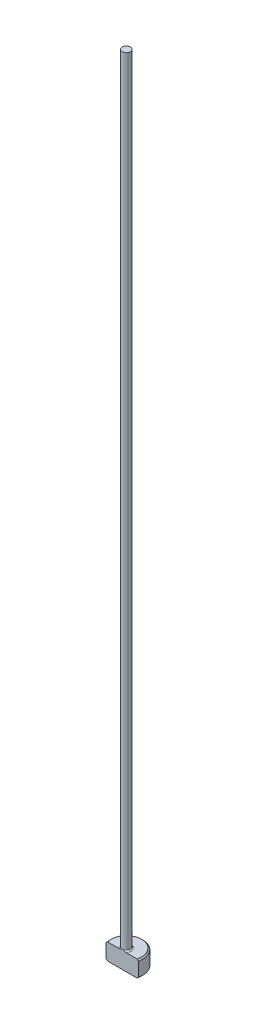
ISO-10303-21;
HEADER;
FILE_DESCRIPTION(('STEP AP214'),'2;1');
FILE_NAME('part.step','',(''),(''),'','','');
FILE_SCHEMA(('AUTOMOTIVE_DESIGN { 1 0 10303 214 1 1 1 1 }'));
ENDSEC;
DATA;
#1=APPLICATION_CONTEXT('core data for automotive mechanical design processes');
#2=APPLICATION_PROTOCOL_DEFINITION('international standard','automotive_design',2000,#1);
#3=PRODUCT_CONTEXT('',#1,'mechanical');
#4=PRODUCT('Part','Part','',(#3));
#5=PRODUCT_RELATED_PRODUCT_CATEGORY('part','',(#4));
#6=PRODUCT_DEFINITION_FORMATION('','',#4);
#7=PRODUCT_DEFINITION_CONTEXT('part definition',#1,'design');
#8=PRODUCT_DEFINITION('design','',#6,#7);
#9=PRODUCT_DEFINITION_SHAPE('','',#8);
#10=(LENGTH_UNIT() NAMED_UNIT(*) SI_UNIT(.MILLI.,.METRE.));
#11=(NAMED_UNIT(*) PLANE_ANGLE_UNIT() SI_UNIT($,.RADIAN.));
#12=(NAMED_UNIT(*) SI_UNIT($,.STERADIAN.) SOLID_ANGLE_UNIT());
#13=UNCERTAINTY_MEASURE_WITH_UNIT(LENGTH_MEASURE(1.E-05),#10,'distance_accuracy_value','');
#14=(GEOMETRIC_REPRESENTATION_CONTEXT(3) GLOBAL_UNCERTAINTY_ASSIGNED_CONTEXT((#13)) GLOBAL_UNIT_ASSIGNED_CONTEXT((#10,
#11,#12)) REPRESENTATION_CONTEXT('',''));
#15=CARTESIAN_POINT('',(0.,0.,0.));
#16=DIRECTION('',(0.,0.,1.));
#17=DIRECTION('',(1.,0.,0.));
#18=AXIS2_PLACEMENT_3D('',#15,#16,#17);
#19=CARTESIAN_POINT('',(0.,0.,0.));
#20=DIRECTION('',(0.,-1.,0.));
#21=DIRECTION('',(0.,0.,-1.));
#22=AXIS2_PLACEMENT_3D('',#19,#20,#21);
#23=PLANE('',#22);
#24=CARTESIAN_POINT('',(0.,0.,0.));
#25=DIRECTION('',(0.,-1.,0.));
#26=DIRECTION('',(0.,0.,-1.));
#27=AXIS2_PLACEMENT_3D('',#24,#25,#26);
#28=CIRCLE('',#27,2.92099999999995);
#29=CARTESIAN_POINT('',(-2.81108554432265,0.,0.793749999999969));
#30=VERTEX_POINT('',#29);
#31=CARTESIAN_POINT('',(2.81108554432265,0.,0.793749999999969));
#32=VERTEX_POINT('',#31);
#33=EDGE_CURVE('E98',#30,#32,#28,.T.);
#34=ORIENTED_EDGE('',*,*,#33,.T.);
#35=DIRECTION('',(-1.,0.,0.));
#36=VECTOR('',#35,1.);
#37=CARTESIAN_POINT('',(-3.07418053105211,0.,0.793749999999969));
#38=LINE('',#37,#36);
#39=EDGE_CURVE('E83',#32,#30,#38,.T.);
#40=ORIENTED_EDGE('',*,*,#39,.T.);
#41=EDGE_LOOP('',(#34,#40));
#42=FACE_BOUND('',#41,.T.);
#43=ADVANCED_FACE('F32',(#42),#23,.T.);
#44=CARTESIAN_POINT('',(0.,259.958771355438,0.));
#45=DIRECTION('',(0.,1.,0.));
#46=DIRECTION('',(0.,0.,1.));
#47=AXIS2_PLACEMENT_3D('',#44,#45,#46);
#48=CYLINDRICAL_SURFACE('',#47,3.17499999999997);
#49=CARTESIAN_POINT('',(0.,2.92099999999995,0.));
#50=DIRECTION('',(0.,1.,0.));
#51=DIRECTION('',(0.,0.,1.));
#52=AXIS2_PLACEMENT_3D('',#49,#50,#51);
#53=CIRCLE('',#52,3.17499999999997);
#54=CARTESIAN_POINT('',(-3.07418053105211,2.92099999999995,0.793749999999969));
#55=VERTEX_POINT('',#54);
#56=CARTESIAN_POINT('',(3.07418053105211,2.92099999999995,0.793749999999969));
#57=VERTEX_POINT('',#56);
#58=EDGE_CURVE('E104',#55,#57,#53,.F.);
#59=ORIENTED_EDGE('',*,*,#58,.T.);
#60=DIRECTION('',(0.,-1.,0.));
#61=VECTOR('',#60,1.);
#62=CARTESIAN_POINT('',(3.07418053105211,152.4,0.793749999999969));
#63=LINE('',#62,#61);
#64=CARTESIAN_POINT('',(3.07418053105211,0.254000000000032,0.793749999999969));
#65=VERTEX_POINT('',#64);
#66=EDGE_CURVE('E183',#57,#65,#63,.T.);
#67=ORIENTED_EDGE('',*,*,#66,.T.);
#68=CARTESIAN_POINT('',(0.,0.254000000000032,0.));
#69=DIRECTION('',(0.,-1.,0.));
#70=DIRECTION('',(0.,0.,-1.));
#71=AXIS2_PLACEMENT_3D('',#68,#69,#70);
#72=CIRCLE('',#71,3.17499999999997);
#73=CARTESIAN_POINT('',(-3.07418053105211,0.254000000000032,0.793749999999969));
#74=VERTEX_POINT('',#73);
#75=EDGE_CURVE('E100',#65,#74,#72,.F.);
#76=ORIENTED_EDGE('',*,*,#75,.T.);
#77=DIRECTION('',(0.,-1.,0.));
#78=VECTOR('',#77,1.);
#79=CARTESIAN_POINT('',(-3.07418053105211,152.4,0.793749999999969));
#80=LINE('',#79,#78);
#81=EDGE_CURVE('E93',#55,#74,#80,.T.);
#82=ORIENTED_EDGE('',*,*,#81,.F.);
#83=EDGE_LOOP('',(#59,#67,#76,#82));
#84=FACE_BOUND('',#83,.T.);
#85=ADVANCED_FACE('F158',(#84),#48,.T.);
#86=CARTESIAN_POINT('',(-3.17499999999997,3.175,0.));
#87=DIRECTION('',(0.,1.,0.));
#88=DIRECTION('',(0.,0.,1.));
#89=AXIS2_PLACEMENT_3D('',#86,#87,#88);
#90=PLANE('',#89);
#91=CARTESIAN_POINT('',(0.,3.175,0.));
#92=DIRECTION('',(0.,1.,0.));
#93=DIRECTION('',(0.,0.,1.));
#94=AXIS2_PLACEMENT_3D('',#91,#92,#93);
#95=CIRCLE('',#94,2.92099999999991);
#96=CARTESIAN_POINT('',(2.8110855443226,3.175,0.793749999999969));
#97=VERTEX_POINT('',#96);
#98=CARTESIAN_POINT('',(-2.8110855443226,3.175,0.793749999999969));
#99=VERTEX_POINT('',#98);
#100=EDGE_CURVE('E178',#97,#99,#95,.T.);
#101=ORIENTED_EDGE('',*,*,#100,.T.);
#102=DIRECTION('',(1.,0.,0.));
#103=VECTOR('',#102,1.);
#104=CARTESIAN_POINT('',(-3.17499999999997,3.175,0.793749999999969));
#105=LINE('',#104,#103);
#106=CARTESIAN_POINT('',(-0.68391593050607,3.17500000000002,0.793749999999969));
#107=VERTEX_POINT('',#106);
#108=EDGE_CURVE('E57',#99,#107,#105,.T.);
#109=ORIENTED_EDGE('',*,*,#108,.T.);
#110=CARTESIAN_POINT('',(0.,3.175,0.));
#111=DIRECTION('',(0.,1.,0.));
#112=DIRECTION('',(0.,0.,1.));
#113=AXIS2_PLACEMENT_3D('',#110,#111,#112);
#114=CIRCLE('',#113,1.04774999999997);
#115=CARTESIAN_POINT('',(0.683915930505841,3.17500000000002,0.793749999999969));
#116=VERTEX_POINT('',#115);
#117=EDGE_CURVE('E107',#107,#116,#114,.F.);
#118=ORIENTED_EDGE('',*,*,#117,.T.);
#119=EDGE_CURVE('E136',#116,#97,#105,.T.);
#120=ORIENTED_EDGE('',*,*,#119,.T.);
#121=EDGE_LOOP('',(#101,#109,#118,#120));
#122=FACE_BOUND('',#121,.T.);
#123=ADVANCED_FACE('F147',(#122),#90,.T.);
#124=CARTESIAN_POINT('',(0.,3.17499999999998,0.));
#125=DIRECTION('',(0.,-1.,0.));
#126=DIRECTION('',(0.,0.,-1.));
#127=AXIS2_PLACEMENT_3D('',#124,#125,#126);
#128=CONICAL_SURFACE('',#127,2.92099999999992,0.785398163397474);
#129=ORIENTED_EDGE('',*,*,#58,.F.);
#130=CARTESIAN_POINT('',(-6.76654378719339,-0.716940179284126,0.793749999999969));
#131=CARTESIAN_POINT('',(-6.58612847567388,-0.537757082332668,0.793749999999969));
#132=CARTESIAN_POINT('',(-6.4056679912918,-0.358619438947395,0.793749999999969));
#133=CARTESIAN_POINT('',(-6.04458522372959,-0.000434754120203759,0.793749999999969));
#134=CARTESIAN_POINT('',(-5.86396291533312,0.17861226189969,0.793749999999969));
#135=CARTESIAN_POINT('',(-5.50181071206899,0.537283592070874,0.793749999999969));
#136=CARTESIAN_POINT('',(-5.32028015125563,0.71690723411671,0.793749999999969));
#137=CARTESIAN_POINT('',(-4.95703332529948,1.07589430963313,0.793749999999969));
#138=CARTESIAN_POINT('',(-4.77531710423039,1.25525778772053,0.793749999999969));
#139=CARTESIAN_POINT('',(-4.3004608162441,1.72319332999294,0.793749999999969));
#140=CARTESIAN_POINT('',(-4.00708464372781,2.01152633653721,0.793749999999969));
#141=CARTESIAN_POINT('',(-3.56582498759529,2.44302479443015,0.793749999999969));
#142=CARTESIAN_POINT('',(-3.41848369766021,2.5867445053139,0.793749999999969));
#143=CARTESIAN_POINT('',(-3.1232820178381,2.87362456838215,0.793749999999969));
#144=CARTESIAN_POINT('',(-2.97542167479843,3.01678496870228,0.793749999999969));
#145=CARTESIAN_POINT('',(-2.67948713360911,3.30170246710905,0.793749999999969));
#146=CARTESIAN_POINT('',(-2.53141613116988,3.44346288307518,0.793749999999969));
#147=CARTESIAN_POINT('',(-2.23395385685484,3.72569854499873,0.793749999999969));
#148=CARTESIAN_POINT('',(-2.08456216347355,3.86617334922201,0.793749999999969));
#149=CARTESIAN_POINT('',(-1.85887536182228,4.07494512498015,0.793749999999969));
#150=CARTESIAN_POINT('',(-1.78343405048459,4.14416382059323,0.793749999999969));
#151=CARTESIAN_POINT('',(-1.63175147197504,4.28171769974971,0.793749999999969));
#152=CARTESIAN_POINT('',(-1.55551023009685,4.35005291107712,0.793749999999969));
#153=CARTESIAN_POINT('',(-1.40191671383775,4.48538182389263,0.793749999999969));
#154=CARTESIAN_POINT('',(-1.32456505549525,4.55237622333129,0.793749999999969));
#155=CARTESIAN_POINT('',(-1.16814829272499,4.6843274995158,0.793749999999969));
#156=CARTESIAN_POINT('',(-1.08908357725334,4.74928483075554,0.793749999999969));
#157=CARTESIAN_POINT('',(-0.978646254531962,4.83605857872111,0.793749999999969));
#158=CARTESIAN_POINT('',(-0.948460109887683,4.85938268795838,0.793749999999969));
#159=CARTESIAN_POINT('',(-0.887614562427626,4.90541183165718,0.793749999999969));
#160=CARTESIAN_POINT('',(-0.856955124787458,4.92811682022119,0.793749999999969));
#161=CARTESIAN_POINT('',(-0.794984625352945,4.97280020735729,0.793749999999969));
#162=CARTESIAN_POINT('',(-0.763672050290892,4.99477651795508,0.793749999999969));
#163=CARTESIAN_POINT('',(-0.70035270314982,5.03770392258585,0.793749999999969));
#164=CARTESIAN_POINT('',(-0.668345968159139,5.05865507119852,0.793749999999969));
#165=CARTESIAN_POINT('',(-0.604596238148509,5.09851389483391,0.793749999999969));
#166=CARTESIAN_POINT('',(-0.572882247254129,5.11746713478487,0.793749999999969));
#167=CARTESIAN_POINT('',(-0.508518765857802,5.15370377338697,0.793749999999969));
#168=CARTESIAN_POINT('',(-0.475868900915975,5.17098649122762,0.793749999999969));
#169=CARTESIAN_POINT('',(-0.376526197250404,5.2193739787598,0.793749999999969));
#170=CARTESIAN_POINT('',(-0.308073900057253,5.24726182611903,0.793749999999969));
#171=CARTESIAN_POINT('',(-0.214532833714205,5.27405975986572,0.793749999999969));
#172=CARTESIAN_POINT('',(-0.191393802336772,5.27981785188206,0.793749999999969));
#173=CARTESIAN_POINT('',(-0.144729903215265,5.28948827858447,0.793749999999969));
#174=CARTESIAN_POINT('',(-0.121204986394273,5.2934003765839,0.793749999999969));
#175=CARTESIAN_POINT('',(-0.0504134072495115,5.30201256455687,0.793749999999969));
#176=CARTESIAN_POINT('',(-0.00272310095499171,5.30365123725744,0.793749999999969));
#177=CARTESIAN_POINT('',(0.0920811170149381,5.29833583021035,0.793749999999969));
#178=CARTESIAN_POINT('',(0.139195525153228,5.29138976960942,0.793749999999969));
#179=CARTESIAN_POINT('',(0.23192594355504,5.27030742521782,0.793749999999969));
#180=CARTESIAN_POINT('',(0.277534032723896,5.25613809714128,0.793749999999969));
#181=CARTESIAN_POINT('',(0.379024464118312,5.21798849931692,0.793749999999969));
#182=CARTESIAN_POINT('',(0.434273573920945,5.19238048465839,0.793749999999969));
#183=CARTESIAN_POINT('',(0.542067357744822,5.13591410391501,0.793749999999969));
#184=CARTESIAN_POINT('',(0.594605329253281,5.10504346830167,0.793749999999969));
#185=CARTESIAN_POINT('',(0.697964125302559,5.03978970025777,0.793749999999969));
#186=CARTESIAN_POINT('',(0.748769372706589,5.00538227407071,0.793749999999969));
#187=CARTESIAN_POINT('',(0.848768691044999,4.9344445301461,0.793749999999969));
#188=CARTESIAN_POINT('',(0.897964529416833,4.89791667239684,0.793749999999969));
#189=CARTESIAN_POINT('',(1.0011020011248,4.81888727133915,0.793749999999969));
#190=CARTESIAN_POINT('',(1.05489843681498,4.77619738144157,0.793749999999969));
#191=CARTESIAN_POINT('',(1.1614670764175,4.68955385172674,0.793749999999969));
#192=CARTESIAN_POINT('',(1.21423916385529,4.64560006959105,0.793749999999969));
#193=CARTESIAN_POINT('',(1.37147314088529,4.51238432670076,0.793749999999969));
#194=CARTESIAN_POINT('',(1.47481171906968,4.42180042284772,0.793749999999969));
#195=CARTESIAN_POINT('',(1.67990723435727,4.23856991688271,0.793749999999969));
#196=CARTESIAN_POINT('',(1.78166152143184,4.14592038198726,0.793749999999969));
#197=CARTESIAN_POINT('',(1.9840360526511,3.9594386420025,0.793749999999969));
#198=CARTESIAN_POINT('',(2.08465655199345,3.86560671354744,0.793749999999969));
#199=CARTESIAN_POINT('',(2.28470036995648,3.67758310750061,0.793749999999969));
#200=CARTESIAN_POINT('',(2.38412704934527,3.58339499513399,0.793749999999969));
#201=CARTESIAN_POINT('',(2.58246726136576,3.39446890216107,0.793749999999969));
#202=CARTESIAN_POINT('',(2.68138076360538,3.29973088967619,0.793749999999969));
#203=CARTESIAN_POINT('',(2.97740330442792,3.0150901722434,0.793749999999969));
#204=CARTESIAN_POINT('',(3.17395519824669,2.82460855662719,0.793749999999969));
#205=CARTESIAN_POINT('',(3.65457059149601,2.35679110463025,0.793749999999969));
#206=CARTESIAN_POINT('',(3.93817207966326,2.07898169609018,0.793749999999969));
#207=CARTESIAN_POINT('',(4.50454370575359,1.52234859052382,0.793749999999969));
#208=CARTESIAN_POINT('',(4.78731356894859,1.24352461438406,0.793749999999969));
#209=CARTESIAN_POINT('',(5.35306828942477,0.684582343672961,0.793749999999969));
#210=CARTESIAN_POINT('',(5.6360516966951,0.404462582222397,0.793749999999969));
#211=CARTESIAN_POINT('',(6.20156797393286,-0.156054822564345,0.793749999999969));
#212=CARTESIAN_POINT('',(6.48410095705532,-0.43645235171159,0.793749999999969));
#213=CARTESIAN_POINT('',(6.76654378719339,-0.716940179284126,0.793749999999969));
#214=B_SPLINE_CURVE_WITH_KNOTS('',3,(#130,#131,#132,#133,#134,#135,#136,#137,#138,#139,#140,
#141,#142,#143,#144,#145,#146,#147,#148,#149,#150,#151,#152,#153,#154,#155,#156,#157,#158,#159,
#160,#161,#162,#163,#164,#165,#166,#167,#168,#169,#170,#171,#172,#173,#174,#175,#176,#177,#178,
#179,#180,#181,#182,#183,#184,#185,#186,#187,#188,#189,#190,#191,#192,#193,#194,#195,#196,#197,
#198,#199,#200,#201,#202,#203,#204,#205,#206,#207,#208,#209,#210,#211,#212,#213),.UNSPECIFIED.,
.F.,.F.,(4,2,2,2,2,2,2,2,2,2,2,2,2,2,2,2,2,2,2,2,2,2,2,2,2,2,2,2,2,2,2,2,2,2,2,2,2,2,2,2,2,4),
(0.,0.76282791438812,1.52580903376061,2.29194326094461,3.0579252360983,4.29195946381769,
4.90944009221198,5.52686635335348,6.14183419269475,6.75700594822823,7.06415568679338,
7.37129574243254,7.67827152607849,7.98517832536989,8.09961411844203,8.21405837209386,
8.32880631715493,8.44354814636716,8.5543309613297,8.665158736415,8.88549900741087,
8.95696802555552,9.0284462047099,9.17076254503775,9.3129460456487,9.45578590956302,
9.63799856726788,9.82064200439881,10.0046365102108,10.1884216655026,10.3944233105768,
10.6004482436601,11.0126549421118,11.4254897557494,11.8382297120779,12.2490965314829,
12.6599874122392,13.4811048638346,14.6720966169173,15.8634454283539,17.0579826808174,
18.2521466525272),.UNSPECIFIED.);
#215=EDGE_CURVE('E135',#55,#99,#214,.T.);
#216=ORIENTED_EDGE('',*,*,#215,.T.);
#217=ORIENTED_EDGE('',*,*,#100,.F.);
#218=EDGE_CURVE('E127',#97,#57,#214,.T.);
#219=ORIENTED_EDGE('',*,*,#218,.T.);
#220=EDGE_LOOP('',(#129,#216,#217,#219));
#221=FACE_BOUND('',#220,.T.);
#222=ADVANCED_FACE('F143',(#221),#128,.T.);
#223=CARTESIAN_POINT('',(0.,0.254000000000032,0.));
#224=DIRECTION('',(0.,1.,0.));
#225=DIRECTION('',(0.,0.,1.));
#226=AXIS2_PLACEMENT_3D('',#223,#224,#225);
#227=CONICAL_SURFACE('',#226,3.17499999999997,0.785398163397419);
#228=ORIENTED_EDGE('',*,*,#75,.F.);
#229=CARTESIAN_POINT('',(6.76654378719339,3.89194017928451,0.793749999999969));
#230=CARTESIAN_POINT('',(6.58612847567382,3.71275708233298,0.793749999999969));
#231=CARTESIAN_POINT('',(6.40566799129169,3.53361943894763,0.793749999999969));
#232=CARTESIAN_POINT('',(6.04458522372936,3.17543475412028,0.793749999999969));
#233=CARTESIAN_POINT('',(5.86396291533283,2.99638773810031,0.793749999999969));
#234=CARTESIAN_POINT('',(5.50181071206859,2.63771640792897,0.793749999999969));
#235=CARTESIAN_POINT('',(5.32028015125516,2.45809276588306,0.793749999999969));
#236=CARTESIAN_POINT('',(4.95703332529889,2.09910569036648,0.793749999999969));
#237=CARTESIAN_POINT('',(4.77531710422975,1.919742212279,0.793749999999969));
#238=CARTESIAN_POINT('',(4.30046081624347,1.45180667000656,0.793749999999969));
#239=CARTESIAN_POINT('',(4.00708464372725,1.16347366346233,0.793749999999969));
#240=CARTESIAN_POINT('',(3.56582498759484,0.731975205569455,0.793749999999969));
#241=CARTESIAN_POINT('',(3.4184836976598,0.588255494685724,0.793749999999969));
#242=CARTESIAN_POINT('',(3.12328201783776,0.30137543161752,0.793749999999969));
#243=CARTESIAN_POINT('',(2.97542167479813,0.1582150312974,0.793749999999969));
#244=CARTESIAN_POINT('',(2.67948713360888,-0.12670246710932,0.793749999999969));
#245=CARTESIAN_POINT('',(2.53141613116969,-0.268462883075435,0.793749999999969));
#246=CARTESIAN_POINT('',(2.23395385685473,-0.550698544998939,0.793749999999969));
#247=CARTESIAN_POINT('',(2.08456216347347,-0.691173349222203,0.793749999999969));
#248=CARTESIAN_POINT('',(1.85887536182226,-0.899945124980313,0.793749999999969));
#249=CARTESIAN_POINT('',(1.78343405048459,-0.969163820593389,0.793749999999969));
#250=CARTESIAN_POINT('',(1.63175147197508,-1.10671769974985,0.793749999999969));
#251=CARTESIAN_POINT('',(1.5555102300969,-1.17505291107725,0.793749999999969));
#252=CARTESIAN_POINT('',(1.40191671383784,-1.31038182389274,0.793749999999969));
#253=CARTESIAN_POINT('',(1.32456505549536,-1.37737622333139,0.793749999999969));
#254=CARTESIAN_POINT('',(1.16814829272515,-1.50932749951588,0.793749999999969));
#255=CARTESIAN_POINT('',(1.08908357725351,-1.57428483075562,0.793749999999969));
#256=CARTESIAN_POINT('',(0.978646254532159,-1.66105857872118,0.793749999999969));
#257=CARTESIAN_POINT('',(0.948460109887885,-1.68438268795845,0.793749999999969));
#258=CARTESIAN_POINT('',(0.887614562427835,-1.73041183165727,0.793749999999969));
#259=CARTESIAN_POINT('',(0.856955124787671,-1.75311682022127,0.793749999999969));
#260=CARTESIAN_POINT('',(0.794984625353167,-1.79780020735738,0.793749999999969));
#261=CARTESIAN_POINT('',(0.763672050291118,-1.81977651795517,0.793749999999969));
#262=CARTESIAN_POINT('',(0.700352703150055,-1.86270392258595,0.793749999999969));
#263=CARTESIAN_POINT('',(0.668345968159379,-1.88365507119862,0.793749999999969));
#264=CARTESIAN_POINT('',(0.604596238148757,-1.92351389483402,0.793749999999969));
#265=CARTESIAN_POINT('',(0.57288224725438,-1.94246713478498,0.793749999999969));
#266=CARTESIAN_POINT('',(0.50851876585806,-1.97870377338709,0.793749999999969));
#267=CARTESIAN_POINT('',(0.475868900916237,-1.99598649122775,0.793749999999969));
#268=CARTESIAN_POINT('',(0.376526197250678,-2.04437397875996,0.793749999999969));
#269=CARTESIAN_POINT('',(0.308073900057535,-2.0722618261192,0.793749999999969));
#270=CARTESIAN_POINT('',(0.214532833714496,-2.09905975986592,0.793749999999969));
#271=CARTESIAN_POINT('',(0.191393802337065,-2.10481785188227,0.793749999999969));
#272=CARTESIAN_POINT('',(0.144729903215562,-2.1144882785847,0.793749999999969));
#273=CARTESIAN_POINT('',(0.121204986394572,-2.11840037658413,0.793749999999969));
#274=CARTESIAN_POINT('',(0.050413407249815,-2.12701256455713,0.793749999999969));
#275=CARTESIAN_POINT('',(0.00272310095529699,-2.12865123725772,0.793749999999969));
#276=CARTESIAN_POINT('',(-0.0920811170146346,-2.12333583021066,0.793749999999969));
#277=CARTESIAN_POINT('',(-0.139195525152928,-2.11638976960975,0.793749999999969));
#278=CARTESIAN_POINT('',(-0.231925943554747,-2.09530742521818,0.793749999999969));
#279=CARTESIAN_POINT('',(-0.277534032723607,-2.08113809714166,0.793749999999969));
#280=CARTESIAN_POINT('',(-0.379024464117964,-2.04298849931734,0.793749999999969));
#281=CARTESIAN_POINT('',(-0.434273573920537,-2.01738048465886,0.793749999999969));
#282=CARTESIAN_POINT('',(-0.542067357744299,-1.96091410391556,0.793749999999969));
#283=CARTESIAN_POINT('',(-0.594605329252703,-1.93004346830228,0.793749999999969));
#284=CARTESIAN_POINT('',(-0.69796412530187,-1.86478970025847,0.793749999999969));
#285=CARTESIAN_POINT('',(-0.748769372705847,-1.83038227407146,0.793749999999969));
#286=CARTESIAN_POINT('',(-0.848768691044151,-1.75944453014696,0.793749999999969));
#287=CARTESIAN_POINT('',(-0.897964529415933,-1.72291667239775,0.793749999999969));
#288=CARTESIAN_POINT('',(-1.00110200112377,-1.64388727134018,0.793749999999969));
#289=CARTESIAN_POINT('',(-1.05489843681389,-1.60119738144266,0.793749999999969));
#290=CARTESIAN_POINT('',(-1.16146707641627,-1.51455385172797,0.793749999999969));
#291=CARTESIAN_POINT('',(-1.21423916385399,-1.47060006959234,0.793749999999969));
#292=CARTESIAN_POINT('',(-1.37147314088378,-1.33738432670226,0.793749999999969));
#293=CARTESIAN_POINT('',(-1.47481171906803,-1.24680042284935,0.793749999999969));
#294=CARTESIAN_POINT('',(-1.67990723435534,-1.06356991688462,0.793749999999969));
#295=CARTESIAN_POINT('',(-1.78166152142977,-0.970920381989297,0.793749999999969));
#296=CARTESIAN_POINT('',(-1.98403605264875,-0.784438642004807,0.793749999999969));
#297=CARTESIAN_POINT('',(-2.08465655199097,-0.690606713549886,0.793749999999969));
#298=CARTESIAN_POINT('',(-2.28470036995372,-0.502583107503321,0.793749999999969));
#299=CARTESIAN_POINT('',(-2.38412704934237,-0.408394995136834,0.793749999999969));
#300=CARTESIAN_POINT('',(-2.58246726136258,-0.219468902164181,0.793749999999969));
#301=CARTESIAN_POINT('',(-2.68138076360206,-0.12473088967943,0.793749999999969));
#302=CARTESIAN_POINT('',(-2.97740330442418,0.159909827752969,0.793749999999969));
#303=CARTESIAN_POINT('',(-3.17395519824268,0.350391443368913,0.793749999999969));
#304=CARTESIAN_POINT('',(-3.65457059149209,0.818208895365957,0.793749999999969));
#305=CARTESIAN_POINT('',(-3.9381720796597,1.09601830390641,0.793749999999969));
#306=CARTESIAN_POINT('',(-4.50454370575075,1.65265140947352,0.793749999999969));
#307=CARTESIAN_POINT('',(-4.78731356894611,1.93147538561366,0.793749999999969));
#308=CARTESIAN_POINT('',(-5.35306828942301,2.49041765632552,0.793749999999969));
#309=CARTESIAN_POINT('',(-5.63605169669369,2.77053741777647,0.793749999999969));
#310=CARTESIAN_POINT('',(-6.20156797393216,3.33105482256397,0.793749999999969));
#311=CARTESIAN_POINT('',(-6.48410095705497,3.61145235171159,0.793749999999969));
#312=CARTESIAN_POINT('',(-6.76654378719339,3.89194017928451,0.793749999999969));
#313=B_SPLINE_CURVE_WITH_KNOTS('',3,(#229,#230,#231,#232,#233,#234,#235,#236,#237,#238,#239,
#240,#241,#242,#243,#244,#245,#246,#247,#248,#249,#250,#251,#252,#253,#254,#255,#256,#257,#258,
#259,#260,#261,#262,#263,#264,#265,#266,#267,#268,#269,#270,#271,#272,#273,#274,#275,#276,#277,
#278,#279,#280,#281,#282,#283,#284,#285,#286,#287,#288,#289,#290,#291,#292,#293,#294,#295,#296,
#297,#298,#299,#300,#301,#302,#303,#304,#305,#306,#307,#308,#309,#310,#311,#312),.UNSPECIFIED.,
.F.,.F.,(4,2,2,2,2,2,2,2,2,2,2,2,2,2,2,2,2,2,2,2,2,2,2,2,2,2,2,2,2,2,2,2,2,2,2,2,2,2,2,2,2,4),
(0.,0.762827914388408,1.52580903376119,2.29194326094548,3.05792523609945,4.2919594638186,
4.90944009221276,5.52686635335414,6.14183419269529,6.75700594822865,7.06415568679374,
7.37129574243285,7.67827152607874,7.98517832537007,8.0996141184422,8.21405837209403,
8.32880631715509,8.44354814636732,8.55433096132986,8.66515873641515,8.88549900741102,
8.95696802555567,9.02844620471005,9.1707625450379,9.31294604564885,9.45578590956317,
9.63799856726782,9.82064200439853,10.0046365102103,10.1884216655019,10.3944233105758,
10.6004482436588,11.0126549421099,11.4254897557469,11.8382297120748,12.2490965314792,
12.659987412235,13.4811048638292,14.6720966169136,15.8634454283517,17.0579826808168,
18.2521466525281),.UNSPECIFIED.);
#314=EDGE_CURVE('E86',#65,#32,#313,.T.);
#315=ORIENTED_EDGE('',*,*,#314,.T.);
#316=ORIENTED_EDGE('',*,*,#33,.F.);
#317=EDGE_CURVE('E89',#30,#74,#313,.T.);
#318=ORIENTED_EDGE('',*,*,#317,.T.);
#319=EDGE_LOOP('',(#228,#315,#316,#318));
#320=FACE_BOUND('',#319,.T.);
#321=ADVANCED_FACE('F97',(#320),#227,.T.);
#322=CARTESIAN_POINT('',(0.,3.42900000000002,0.));
#323=DIRECTION('',(0.,1.,0.));
#324=DIRECTION('',(0.,0.,1.));
#325=AXIS2_PLACEMENT_3D('',#322,#323,#324);
#326=TOROIDAL_SURFACE('',#325,1.04774999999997,0.254);
#327=CARTESIAN_POINT('',(0.,3.42900000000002,0.793749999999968));
#328=CARTESIAN_POINT('',(1.00594056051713E-09,3.42900059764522,0.793749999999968));
#329=CARTESIAN_POINT('',(8.25543152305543E-08,3.42900119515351,0.793749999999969));
#330=CARTESIAN_POINT('',(3.5984520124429E-07,3.42900236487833,0.793749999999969));
#331=CARTESIAN_POINT('',(5.56611927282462E-07,3.42900293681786,0.793749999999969));
#332=CARTESIAN_POINT('',(1.03793284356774E-06,3.4290040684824,0.793749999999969));
#333=CARTESIAN_POINT('',(1.32565590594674E-06,3.42900462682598,0.793749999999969));
#334=CARTESIAN_POINT('',(1.96199956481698E-06,3.42900570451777,0.793749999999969));
#335=CARTESIAN_POINT('',(2.31046732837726E-06,3.42900622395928,0.793749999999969));
#336=CARTESIAN_POINT('',(3.51238455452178E-06,3.42900787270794,0.793749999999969));
#337=CARTESIAN_POINT('',(4.44738386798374E-06,3.42900894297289,0.793749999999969));
#338=CARTESIAN_POINT('',(6.43338757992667E-06,3.42901092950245,0.793749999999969));
#339=CARTESIAN_POINT('',(7.48242245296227E-06,3.42901184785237,0.793749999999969));
#340=CARTESIAN_POINT('',(1.13526860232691E-05,3.42901504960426,0.793749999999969));
#341=CARTESIAN_POINT('',(1.43190067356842E-05,3.42901716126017,0.793749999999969));
#342=CARTESIAN_POINT('',(2.03448799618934E-05,3.42902083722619,0.793749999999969));
#343=CARTESIAN_POINT('',(2.33909441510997E-05,3.4290224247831,0.793749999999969));
#344=CARTESIAN_POINT('',(3.56627691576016E-05,3.42902869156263,0.793749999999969));
#345=CARTESIAN_POINT('',(4.49891926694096E-05,3.42903316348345,0.793749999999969));
#346=CARTESIAN_POINT('',(6.2853777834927E-05,3.42904079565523,0.793749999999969));
#347=CARTESIAN_POINT('',(7.13510645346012E-05,3.42904404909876,0.793749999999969));
#348=CARTESIAN_POINT('',(0.000129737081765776,3.4290683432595,0.793749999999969));
#349=CARTESIAN_POINT('',(0.000175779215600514,3.4290975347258,0.793749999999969));
#350=CARTESIAN_POINT('',(0.000350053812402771,3.42920359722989,0.793749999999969));
#351=CARTESIAN_POINT('',(0.00048099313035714,3.42927442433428,0.793749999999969));
#352=CARTESIAN_POINT('',(0.000972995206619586,3.42954494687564,0.793749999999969));
#353=CARTESIAN_POINT('',(0.00133127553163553,3.42975090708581,0.793749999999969));
#354=CARTESIAN_POINT('',(0.00275914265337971,3.43056728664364,0.793749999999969));
#355=CARTESIAN_POINT('',(0.00383182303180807,3.43117068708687,0.793749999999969));
#356=CARTESIAN_POINT('',(0.0249852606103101,3.44307504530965,0.793749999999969));
#357=CARTESIAN_POINT('',(0.0450341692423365,3.45445024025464,0.793749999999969));
#358=CARTESIAN_POINT('',(0.0846093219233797,3.47663493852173,0.793749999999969));
#359=CARTESIAN_POINT('',(0.104132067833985,3.487450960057,0.793749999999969));
#360=CARTESIAN_POINT('',(0.145314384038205,3.50987127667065,0.793749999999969));
#361=CARTESIAN_POINT('',(0.166990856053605,3.52144503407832,0.793749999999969));
#362=CARTESIAN_POINT('',(0.210829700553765,3.54412234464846,0.793749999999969));
#363=CARTESIAN_POINT('',(0.232994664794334,3.55522089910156,0.793749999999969));
#364=CARTESIAN_POINT('',(0.289745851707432,3.58237702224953,0.793749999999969));
#365=CARTESIAN_POINT('',(0.324598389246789,3.59788963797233,0.793749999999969));
#366=CARTESIAN_POINT('',(0.394732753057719,3.62578193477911,0.793749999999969));
#367=CARTESIAN_POINT('',(0.429990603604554,3.63822002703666,0.793749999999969));
#368=CARTESIAN_POINT('',(0.486020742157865,3.65466140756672,0.793749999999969));
#369=CARTESIAN_POINT('',(0.506403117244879,3.65997735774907,0.793749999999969));
#370=CARTESIAN_POINT('',(0.547581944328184,3.66916489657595,0.793749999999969));
#371=CARTESIAN_POINT('',(0.568379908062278,3.67302947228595,0.793749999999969));
#372=CARTESIAN_POINT('',(0.632823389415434,3.68222555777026,0.793749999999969));
#373=CARTESIAN_POINT('',(0.677005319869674,3.6846711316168,0.793749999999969));
#374=CARTESIAN_POINT('',(0.74175190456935,3.68045811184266,0.793749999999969));
#375=CARTESIAN_POINT('',(0.762598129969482,3.67788777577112,0.793749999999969));
#376=CARTESIAN_POINT('',(0.803620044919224,3.66996519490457,0.793749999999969));
#377=CARTESIAN_POINT('',(0.823799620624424,3.66463419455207,0.793749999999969));
#378=CARTESIAN_POINT('',(0.863382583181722,3.65071566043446,0.793749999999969));
#379=CARTESIAN_POINT('',(0.882769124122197,3.64207900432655,0.793749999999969));
#380=CARTESIAN_POINT('',(0.919550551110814,3.62121223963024,0.793749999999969));
#381=CARTESIAN_POINT('',(0.936947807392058,3.6089864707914,0.793749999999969));
#382=CARTESIAN_POINT('',(0.962807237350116,3.5859668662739,0.793749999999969));
#383=CARTESIAN_POINT('',(0.972229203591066,3.57624640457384,0.793749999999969));
#384=CARTESIAN_POINT('',(0.989372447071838,3.55540033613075,0.793749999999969));
#385=CARTESIAN_POINT('',(0.997095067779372,3.54427585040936,0.793749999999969));
#386=CARTESIAN_POINT('',(1.01049428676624,3.52073386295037,0.793749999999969));
#387=CARTESIAN_POINT('',(1.01615519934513,3.50830733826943,0.793749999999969));
#388=CARTESIAN_POINT('',(1.02498233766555,3.48259444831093,0.793749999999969));
#389=CARTESIAN_POINT('',(1.02815025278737,3.46930867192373,0.793749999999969));
#390=CARTESIAN_POINT('',(1.03155096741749,3.44397291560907,0.793749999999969));
#391=CARTESIAN_POINT('',(1.03208709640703,3.43196305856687,0.793749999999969));
#392=CARTESIAN_POINT('',(1.03101637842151,3.40804163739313,0.793749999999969));
#393=CARTESIAN_POINT('',(1.02941018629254,3.39613004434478,0.793749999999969));
#394=CARTESIAN_POINT('',(1.02428560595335,3.37336758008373,0.793749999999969));
#395=CARTESIAN_POINT('',(1.02086846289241,3.36249356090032,0.793749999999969));
#396=CARTESIAN_POINT('',(1.01236081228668,3.34142542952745,0.793749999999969));
#397=CARTESIAN_POINT('',(1.00727011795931,3.33123139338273,0.793749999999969));
#398=CARTESIAN_POINT('',(0.995273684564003,3.31111130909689,0.793749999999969));
#399=CARTESIAN_POINT('',(0.988275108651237,3.30124089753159,0.793749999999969));
#400=CARTESIAN_POINT('',(0.972923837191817,3.28262339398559,0.793749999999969));
#401=CARTESIAN_POINT('',(0.964570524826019,3.27387681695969,0.793749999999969));
#402=CARTESIAN_POINT('',(0.943078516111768,3.25417715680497,0.793749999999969));
#403=CARTESIAN_POINT('',(0.929393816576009,3.24381776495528,0.793749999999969));
#404=CARTESIAN_POINT('',(0.900512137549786,3.2254571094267,0.793749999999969));
#405=CARTESIAN_POINT('',(0.885311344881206,3.21746200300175,0.793749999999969));
#406=CARTESIAN_POINT('',(0.848269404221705,3.20122250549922,0.793749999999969));
#407=CARTESIAN_POINT('',(0.826012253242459,3.19393028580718,0.793749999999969));
#408=CARTESIAN_POINT('',(0.780723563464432,3.18300053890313,0.793749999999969));
#409=CARTESIAN_POINT('',(0.75769381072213,3.17935511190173,0.793749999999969));
#410=CARTESIAN_POINT('',(0.699883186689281,3.17409624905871,0.793749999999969));
#411=CARTESIAN_POINT('',(0.664934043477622,3.17438476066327,0.793749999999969));
#412=CARTESIAN_POINT('',(0.594912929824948,3.18030030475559,0.793749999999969));
#413=CARTESIAN_POINT('',(0.559851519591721,3.18602988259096,0.793749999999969));
#414=CARTESIAN_POINT('',(0.482838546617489,3.20336698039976,0.793749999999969));
#415=CARTESIAN_POINT('',(0.44112931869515,3.2160134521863,0.793749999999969));
#416=CARTESIAN_POINT('',(0.359235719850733,3.24555160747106,0.793749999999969));
#417=CARTESIAN_POINT('',(0.319054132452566,3.26245064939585,0.793749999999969));
#418=CARTESIAN_POINT('',(0.243269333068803,3.29746035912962,0.793749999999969));
#419=CARTESIAN_POINT('',(0.207563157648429,3.31535360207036,0.793749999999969));
#420=CARTESIAN_POINT('',(0.137215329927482,3.35230149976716,0.793749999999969));
#421=CARTESIAN_POINT('',(0.1025666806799,3.37134307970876,0.793749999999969));
#422=CARTESIAN_POINT('',(0.0588159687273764,3.39581599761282,0.793749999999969));
#423=CARTESIAN_POINT('',(0.0495777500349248,3.4010080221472,0.793749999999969));
#424=CARTESIAN_POINT('',(0.0342003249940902,3.40966841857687,0.793749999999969));
#425=CARTESIAN_POINT('',(0.028058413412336,3.41313227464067,0.793749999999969));
#426=CARTESIAN_POINT('',(0.0162490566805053,3.41981335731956,0.793749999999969));
#427=CARTESIAN_POINT('',(0.0105810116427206,3.42302933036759,0.793749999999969));
#428=CARTESIAN_POINT('',(0.00384046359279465,3.42682478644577,0.793749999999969));
#429=CARTESIAN_POINT('',(0.00277621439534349,3.42742318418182,0.793749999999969));
#430=CARTESIAN_POINT('',(0.00135061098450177,3.42823816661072,0.793749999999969));
#431=CARTESIAN_POINT('',(0.000986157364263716,3.42844769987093,0.793749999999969));
#432=CARTESIAN_POINT('',(0.000486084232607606,3.4287226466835,0.793749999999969));
#433=CARTESIAN_POINT('',(0.000353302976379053,3.42879446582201,0.793749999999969));
#434=CARTESIAN_POINT('',(0.000176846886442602,3.42890187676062,0.793749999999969));
#435=CARTESIAN_POINT('',(0.000130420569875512,3.42893131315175,0.793749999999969));
#436=CARTESIAN_POINT('',(7.15678594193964E-05,3.42895575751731,0.793749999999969));
#437=CARTESIAN_POINT('',(6.30330597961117E-05,3.4289590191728,0.793749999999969));
#438=CARTESIAN_POINT('',(4.50899390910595E-05,3.42896668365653,0.793749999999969));
#439=CARTESIAN_POINT('',(3.57233964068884E-05,3.428971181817,0.793749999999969));
#440=CARTESIAN_POINT('',(2.34063299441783E-05,3.42897748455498,0.793749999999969));
#441=CARTESIAN_POINT('',(2.03534438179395E-05,3.42897907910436,0.793749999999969));
#442=CARTESIAN_POINT('',(1.43153651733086E-05,3.42898277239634,0.793749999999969));
#443=CARTESIAN_POINT('',(1.13438162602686E-05,3.42898489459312,0.793749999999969));
#444=CARTESIAN_POINT('',(7.46894567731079E-06,3.42898811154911,0.793749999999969));
#445=CARTESIAN_POINT('',(6.41931602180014E-06,3.42898903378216,0.793749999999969));
#446=CARTESIAN_POINT('',(4.43292995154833E-06,3.42899102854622,0.793749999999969));
#447=CARTESIAN_POINT('',(3.49816033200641E-06,3.42899210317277,0.793749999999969));
#448=CARTESIAN_POINT('',(2.29751703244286E-06,3.42899375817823,0.793749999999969));
#449=CARTESIAN_POINT('',(1.94960798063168E-06,3.42899427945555,0.793749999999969));
#450=CARTESIAN_POINT('',(1.31469934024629E-06,3.42899536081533,0.793749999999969));
#451=CARTESIAN_POINT('',(1.0278538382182E-06,3.42899592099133,0.793749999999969));
#452=CARTESIAN_POINT('',(5.48672660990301E-07,3.42899705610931,0.793749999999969));
#453=CARTESIAN_POINT('',(3.53146210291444E-07,3.42899762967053,0.793749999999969));
#454=CARTESIAN_POINT('',(7.88219975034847E-08,3.42899880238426,0.793749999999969));
#455=CARTESIAN_POINT('',(-1.00778188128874E-09,3.42899940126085,0.793749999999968));
#456=CARTESIAN_POINT('',(0.,3.42900000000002,0.793749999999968));
#457=B_SPLINE_CURVE_WITH_KNOTS('',3,(#327,#328,#329,#330,#331,#332,#333,#334,#335,#336,#337,
#338,#339,#340,#341,#342,#343,#344,#345,#346,#347,#348,#349,#350,#351,#352,#353,#354,#355,#356,
#357,#358,#359,#360,#361,#362,#363,#364,#365,#366,#367,#368,#369,#370,#371,#372,#373,#374,#375,
#376,#377,#378,#379,#380,#381,#382,#383,#384,#385,#386,#387,#388,#389,#390,#391,#392,#393,#394,
#395,#396,#397,#398,#399,#400,#401,#402,#403,#404,#405,#406,#407,#408,#409,#410,#411,#412,#413,
#414,#415,#416,#417,#418,#419,#420,#421,#422,#423,#424,#425,#426,#427,#428,#429,#430,#431,#432,
#433,#434,#435,#436,#437,#438,#439,#440,#441,#442,#443,#444,#445,#446,#447,#448,#449,#450,#451,
#452,#453,#454,#455,#456),.UNSPECIFIED.,.T.,.F.,(4,2,2,2,2,2,2,2,2,2,2,2,2,2,2,2,2,2,2,2,2,2,2,
2,2,2,2,2,2,2,2,2,2,2,2,2,2,2,2,2,2,2,2,2,2,2,2,2,2,2,2,2,2,2,2,2,2,2,2,2,2,2,2,2,4),(0.,
1.79102258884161E-06,3.59821320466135E-06,5.47699485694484E-06,7.35111600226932E-06,
1.15941335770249E-05,1.57729445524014E-05,2.665071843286E-05,3.69462646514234E-05,
6.79598041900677E-05,9.52269114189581E-05,0.000257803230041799,0.000705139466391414,
0.00194403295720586,0.00563714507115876,0.0747790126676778,0.141736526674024,0.215448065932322,
0.289804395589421,0.404169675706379,0.516158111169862,0.579297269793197,0.642737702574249,
0.774347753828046,0.837211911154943,0.899599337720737,0.962952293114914,1.02622895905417,
1.06668820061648,1.10711534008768,1.14784392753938,1.18854489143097,1.22442273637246,
1.26028961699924,1.29433514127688,1.32838446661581,1.36454119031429,1.40071442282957,
1.45192108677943,1.50325995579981,1.57313432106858,1.64285699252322,1.74712810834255,
1.85340420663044,1.98380168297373,2.11442636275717,2.23419481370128,2.35279155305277,
2.38458316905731,2.40573793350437,2.42528567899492,2.42894945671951,2.43020971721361,
2.43066334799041,2.43082727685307,2.43085465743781,2.43088581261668,2.43089613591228,
2.43090704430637,2.4309112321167,2.43091548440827,2.43091736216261,2.43091924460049,
2.4309210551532,2.43092284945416),.UNSPECIFIED.);
#458=CARTESIAN_POINT('',(0.,3.42900000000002,0.793749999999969));
#459=VERTEX_POINT('',#458);
#460=EDGE_CURVE('E11',#116,#459,#457,.T.);
#461=ORIENTED_EDGE('',*,*,#460,.F.);
#462=ORIENTED_EDGE('',*,*,#117,.F.);
#463=CARTESIAN_POINT('',(0.,3.42900000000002,0.793749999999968));
#464=CARTESIAN_POINT('',(-1.00594061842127E-09,3.42899940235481,0.793749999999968));
#465=CARTESIAN_POINT('',(-8.25543152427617E-08,3.42899880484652,0.793749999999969));
#466=CARTESIAN_POINT('',(-3.5984520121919E-07,3.4289976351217,0.793749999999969));
#467=CARTESIAN_POINT('',(-5.56611927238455E-07,3.42899706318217,0.793749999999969));
#468=CARTESIAN_POINT('',(-1.03793284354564E-06,3.42899593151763,0.793749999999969));
#469=CARTESIAN_POINT('',(-1.32565590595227E-06,3.42899537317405,0.793749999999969));
#470=CARTESIAN_POINT('',(-1.96199956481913E-06,3.42899429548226,0.793749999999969));
#471=CARTESIAN_POINT('',(-2.31046732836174E-06,3.42899377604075,0.793749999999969));
#472=CARTESIAN_POINT('',(-3.51238455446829E-06,3.42899212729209,0.793749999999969));
#473=CARTESIAN_POINT('',(-4.44738386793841E-06,3.42899105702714,0.793749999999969));
#474=CARTESIAN_POINT('',(-6.43338757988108E-06,3.42898907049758,0.793749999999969));
#475=CARTESIAN_POINT('',(-7.48242245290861E-06,3.42898815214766,0.793749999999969));
#476=CARTESIAN_POINT('',(-1.13526860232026E-05,3.42898495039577,0.793749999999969));
#477=CARTESIAN_POINT('',(-1.43190067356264E-05,3.42898283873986,0.793749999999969));
#478=CARTESIAN_POINT('',(-2.03448799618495E-05,3.42897916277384,0.793749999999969));
#479=CARTESIAN_POINT('',(-2.33909441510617E-05,3.42897757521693,0.793749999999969));
#480=CARTESIAN_POINT('',(-3.56627691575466E-05,3.4289713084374,0.793749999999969));
#481=CARTESIAN_POINT('',(-4.49891926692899E-05,3.42896683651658,0.793749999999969));
#482=CARTESIAN_POINT('',(-6.28537778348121E-05,3.4289592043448,0.793749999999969));
#483=CARTESIAN_POINT('',(-7.13510645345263E-05,3.42895595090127,0.793749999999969));
#484=CARTESIAN_POINT('',(-0.00012973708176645,3.42893165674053,0.793749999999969));
#485=CARTESIAN_POINT('',(-0.000175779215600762,3.42890246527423,0.793749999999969));
#486=CARTESIAN_POINT('',(-0.000350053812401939,3.42879640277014,0.793749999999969));
#487=CARTESIAN_POINT('',(-0.000480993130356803,3.42872557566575,0.793749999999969));
#488=CARTESIAN_POINT('',(-0.000972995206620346,3.4284550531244,0.793749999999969));
#489=CARTESIAN_POINT('',(-0.00133127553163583,3.42824909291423,0.793749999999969));
#490=CARTESIAN_POINT('',(-0.00275914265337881,3.42743271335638,0.793749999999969));
#491=CARTESIAN_POINT('',(-0.00383182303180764,3.42682931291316,0.793749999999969));
#492=CARTESIAN_POINT('',(-0.0249852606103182,3.41492495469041,0.793749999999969));
#493=CARTESIAN_POINT('',(-0.0450341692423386,3.4035497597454,0.793749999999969));
#494=CARTESIAN_POINT('',(-0.0846093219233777,3.3813650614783,0.793749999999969));
#495=CARTESIAN_POINT('',(-0.104132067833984,3.37054903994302,0.793749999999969));
#496=CARTESIAN_POINT('',(-0.145314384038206,3.34812872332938,0.793749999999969));
#497=CARTESIAN_POINT('',(-0.166990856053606,3.33655496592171,0.793749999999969));
#498=CARTESIAN_POINT('',(-0.210829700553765,3.31387765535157,0.793749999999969));
#499=CARTESIAN_POINT('',(-0.232994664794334,3.30277910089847,0.793749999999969));
#500=CARTESIAN_POINT('',(-0.289745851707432,3.2756229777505,0.793749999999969));
#501=CARTESIAN_POINT('',(-0.324598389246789,3.2601103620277,0.793749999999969));
#502=CARTESIAN_POINT('',(-0.394732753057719,3.23221806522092,0.793749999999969));
#503=CARTESIAN_POINT('',(-0.429990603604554,3.21977997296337,0.793749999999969));
#504=CARTESIAN_POINT('',(-0.486020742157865,3.20333859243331,0.793749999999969));
#505=CARTESIAN_POINT('',(-0.506403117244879,3.19802264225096,0.793749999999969));
#506=CARTESIAN_POINT('',(-0.547581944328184,3.18883510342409,0.793749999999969));
#507=CARTESIAN_POINT('',(-0.568379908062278,3.18497052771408,0.793749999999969));
#508=CARTESIAN_POINT('',(-0.632823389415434,3.17577444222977,0.793749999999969));
#509=CARTESIAN_POINT('',(-0.677005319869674,3.17332886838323,0.793749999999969));
#510=CARTESIAN_POINT('',(-0.74175190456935,3.17754188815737,0.793749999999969));
#511=CARTESIAN_POINT('',(-0.762598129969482,3.18011222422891,0.793749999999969));
#512=CARTESIAN_POINT('',(-0.803620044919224,3.18803480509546,0.793749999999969));
#513=CARTESIAN_POINT('',(-0.823799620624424,3.19336580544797,0.793749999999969));
#514=CARTESIAN_POINT('',(-0.863382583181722,3.20728433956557,0.793749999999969));
#515=CARTESIAN_POINT('',(-0.882769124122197,3.21592099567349,0.793749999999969));
#516=CARTESIAN_POINT('',(-0.919550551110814,3.23678776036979,0.793749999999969));
#517=CARTESIAN_POINT('',(-0.936947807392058,3.24901352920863,0.793749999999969));
#518=CARTESIAN_POINT('',(-0.962807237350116,3.27203313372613,0.793749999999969));
#519=CARTESIAN_POINT('',(-0.972229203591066,3.28175359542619,0.793749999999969));
#520=CARTESIAN_POINT('',(-0.989372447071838,3.30259966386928,0.793749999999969));
#521=CARTESIAN_POINT('',(-0.997095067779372,3.31372414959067,0.793749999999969));
#522=CARTESIAN_POINT('',(-1.01049428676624,3.33726613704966,0.793749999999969));
#523=CARTESIAN_POINT('',(-1.01615519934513,3.3496926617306,0.793749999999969));
#524=CARTESIAN_POINT('',(-1.02498233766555,3.3754055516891,0.793749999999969));
#525=CARTESIAN_POINT('',(-1.02815025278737,3.3886913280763,0.793749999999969));
#526=CARTESIAN_POINT('',(-1.03155096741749,3.41402708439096,0.793749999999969));
#527=CARTESIAN_POINT('',(-1.03208709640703,3.42603694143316,0.793749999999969));
#528=CARTESIAN_POINT('',(-1.03101637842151,3.4499583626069,0.793749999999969));
#529=CARTESIAN_POINT('',(-1.02941018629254,3.46186995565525,0.793749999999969));
#530=CARTESIAN_POINT('',(-1.02428560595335,3.4846324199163,0.793749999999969));
#531=CARTESIAN_POINT('',(-1.02086846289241,3.49550643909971,0.793749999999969));
#532=CARTESIAN_POINT('',(-1.01236081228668,3.51657457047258,0.793749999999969));
#533=CARTESIAN_POINT('',(-1.00727011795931,3.5267686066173,0.793749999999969));
#534=CARTESIAN_POINT('',(-0.995273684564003,3.54688869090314,0.793749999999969));
#535=CARTESIAN_POINT('',(-0.988275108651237,3.55675910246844,0.793749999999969));
#536=CARTESIAN_POINT('',(-0.972923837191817,3.57537660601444,0.793749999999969));
#537=CARTESIAN_POINT('',(-0.964570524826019,3.58412318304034,0.793749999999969));
#538=CARTESIAN_POINT('',(-0.943078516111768,3.60382284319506,0.793749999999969));
#539=CARTESIAN_POINT('',(-0.92939381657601,3.61418223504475,0.793749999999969));
#540=CARTESIAN_POINT('',(-0.900512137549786,3.63254289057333,0.793749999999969));
#541=CARTESIAN_POINT('',(-0.885311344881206,3.64053799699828,0.793749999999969));
#542=CARTESIAN_POINT('',(-0.848269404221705,3.65677749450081,0.793749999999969));
#543=CARTESIAN_POINT('',(-0.826012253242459,3.66406971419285,0.793749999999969));
#544=CARTESIAN_POINT('',(-0.780723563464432,3.6749994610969,0.793749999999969));
#545=CARTESIAN_POINT('',(-0.75769381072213,3.6786448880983,0.793749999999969));
#546=CARTESIAN_POINT('',(-0.699883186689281,3.68390375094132,0.793749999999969));
#547=CARTESIAN_POINT('',(-0.664934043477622,3.68361523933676,0.793749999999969));
#548=CARTESIAN_POINT('',(-0.594912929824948,3.67769969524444,0.793749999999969));
#549=CARTESIAN_POINT('',(-0.559851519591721,3.67197011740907,0.793749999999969));
#550=CARTESIAN_POINT('',(-0.482838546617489,3.65463301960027,0.793749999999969));
#551=CARTESIAN_POINT('',(-0.441129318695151,3.64198654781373,0.793749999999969));
#552=CARTESIAN_POINT('',(-0.359235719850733,3.61244839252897,0.793749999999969));
#553=CARTESIAN_POINT('',(-0.319054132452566,3.59554935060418,0.793749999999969));
#554=CARTESIAN_POINT('',(-0.243269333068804,3.56053964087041,0.793749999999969));
#555=CARTESIAN_POINT('',(-0.20756315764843,3.54264639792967,0.793749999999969));
#556=CARTESIAN_POINT('',(-0.137215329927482,3.50569850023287,0.793749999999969));
#557=CARTESIAN_POINT('',(-0.1025666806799,3.48665692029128,0.793749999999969));
#558=CARTESIAN_POINT('',(-0.0588159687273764,3.46218400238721,0.793749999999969));
#559=CARTESIAN_POINT('',(-0.0495777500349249,3.45699197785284,0.793749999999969));
#560=CARTESIAN_POINT('',(-0.0342003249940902,3.44833158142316,0.793749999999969));
#561=CARTESIAN_POINT('',(-0.0280584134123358,3.44486772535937,0.793749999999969));
#562=CARTESIAN_POINT('',(-0.0162490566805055,3.43818664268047,0.793749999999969));
#563=CARTESIAN_POINT('',(-0.0105810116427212,3.43497066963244,0.793749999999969));
#564=CARTESIAN_POINT('',(-0.00384046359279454,3.43117521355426,0.793749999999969));
#565=CARTESIAN_POINT('',(-0.00277621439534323,3.43057681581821,0.793749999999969));
#566=CARTESIAN_POINT('',(-0.00135061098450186,3.42976183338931,0.793749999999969));
#567=CARTESIAN_POINT('',(-0.000986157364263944,3.4295523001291,0.793749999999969));
#568=CARTESIAN_POINT('',(-0.000486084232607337,3.42927735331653,0.793749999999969));
#569=CARTESIAN_POINT('',(-0.000353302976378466,3.42920553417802,0.793749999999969));
#570=CARTESIAN_POINT('',(-0.000176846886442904,3.42909812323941,0.793749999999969));
#571=CARTESIAN_POINT('',(-0.000130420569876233,3.42906868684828,0.793749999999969));
#572=CARTESIAN_POINT('',(-7.15678594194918E-05,3.42904424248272,0.793749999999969));
#573=CARTESIAN_POINT('',(-6.30330597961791E-05,3.42904098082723,0.793749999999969));
#574=CARTESIAN_POINT('',(-4.50899390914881E-05,3.4290333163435,0.793749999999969));
#575=CARTESIAN_POINT('',(-3.57233964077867E-05,3.42902881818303,0.793749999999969));
#576=CARTESIAN_POINT('',(-2.34063299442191E-05,3.42902251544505,0.793749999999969));
#577=CARTESIAN_POINT('',(-2.03534438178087E-05,3.42902092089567,0.793749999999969));
#578=CARTESIAN_POINT('',(-1.4315365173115E-05,3.42901722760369,0.793749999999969));
#579=CARTESIAN_POINT('',(-1.13438162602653E-05,3.42901510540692,0.793749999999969));
#580=CARTESIAN_POINT('',(-7.4689456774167E-06,3.42901188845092,0.793749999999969));
#581=CARTESIAN_POINT('',(-6.419316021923E-06,3.42901096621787,0.793749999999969));
#582=CARTESIAN_POINT('',(-4.43292995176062E-06,3.42900897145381,0.793749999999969));
#583=CARTESIAN_POINT('',(-3.49816033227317E-06,3.42900789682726,0.793749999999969));
#584=CARTESIAN_POINT('',(-2.29751703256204E-06,3.4290062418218,0.793749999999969));
#585=CARTESIAN_POINT('',(-1.94960798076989E-06,3.42900572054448,0.793749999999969));
#586=CARTESIAN_POINT('',(-1.31469934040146E-06,3.42900463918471,0.793749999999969));
#587=CARTESIAN_POINT('',(-1.02785383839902E-06,3.42900407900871,0.793749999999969));
#588=CARTESIAN_POINT('',(-5.48672661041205E-07,3.42900294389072,0.793749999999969));
#589=CARTESIAN_POINT('',(-3.53146210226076E-07,3.4290023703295,0.793749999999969));
#590=CARTESIAN_POINT('',(-7.88219973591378E-08,3.42900119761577,0.793749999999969));
#591=CARTESIAN_POINT('',(1.0077819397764E-09,3.42900059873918,0.793749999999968));
#592=CARTESIAN_POINT('',(0.,3.42900000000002,0.793749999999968));
#593=B_SPLINE_CURVE_WITH_KNOTS('',3,(#463,#464,#465,#466,#467,#468,#469,#470,#471,#472,#473,
#474,#475,#476,#477,#478,#479,#480,#481,#482,#483,#484,#485,#486,#487,#488,#489,#490,#491,#492,
#493,#494,#495,#496,#497,#498,#499,#500,#501,#502,#503,#504,#505,#506,#507,#508,#509,#510,#511,
#512,#513,#514,#515,#516,#517,#518,#519,#520,#521,#522,#523,#524,#525,#526,#527,#528,#529,#530,
#531,#532,#533,#534,#535,#536,#537,#538,#539,#540,#541,#542,#543,#544,#545,#546,#547,#548,#549,
#550,#551,#552,#553,#554,#555,#556,#557,#558,#559,#560,#561,#562,#563,#564,#565,#566,#567,#568,
#569,#570,#571,#572,#573,#574,#575,#576,#577,#578,#579,#580,#581,#582,#583,#584,#585,#586,#587,
#588,#589,#590,#591,#592),.UNSPECIFIED.,.T.,.F.,(4,2,2,2,2,2,2,2,2,2,2,2,2,2,2,2,2,2,2,2,2,2,2,
2,2,2,2,2,2,2,2,2,2,2,2,2,2,2,2,2,2,2,2,2,2,2,2,2,2,2,2,2,2,2,2,2,2,2,2,2,2,2,2,2,4),(0.,
1.79102258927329E-06,3.59821320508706E-06,5.47699485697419E-06,7.35111600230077E-06,
1.15941335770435E-05,1.57729445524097E-05,2.66507184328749E-05,3.69462646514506E-05,
6.79598041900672E-05,9.52269114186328E-05,0.000257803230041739,0.000705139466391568,
0.00194403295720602,0.00563714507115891,0.074779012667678,0.141736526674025,0.215448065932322,
0.289804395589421,0.404169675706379,0.516158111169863,0.579297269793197,0.642737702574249,
0.774347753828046,0.837211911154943,0.899599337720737,0.962952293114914,1.02622895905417,
1.06668820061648,1.10711534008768,1.14784392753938,1.18854489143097,1.22442273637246,
1.26028961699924,1.29433514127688,1.32838446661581,1.36454119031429,1.40071442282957,
1.45192108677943,1.50325995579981,1.57313432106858,1.64285699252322,1.74712810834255,
1.85340420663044,1.98380168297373,2.11442636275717,2.23419481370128,2.35279155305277,
2.38458316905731,2.40573793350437,2.42528567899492,2.42894945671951,2.43020971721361,
2.43066334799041,2.43082727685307,2.43085465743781,2.43088581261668,2.43089613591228,
2.43090704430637,2.4309112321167,2.43091548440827,2.4309173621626,2.43091924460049,
2.43092105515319,2.43092284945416),.UNSPECIFIED.);
#594=EDGE_CURVE('E46',#459,#107,#593,.T.);
#595=ORIENTED_EDGE('',*,*,#594,.F.);
#596=CARTESIAN_POINT('',(0.,3.42900000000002,0.));
#597=DIRECTION('',(0.,1.,0.));
#598=DIRECTION('',(0.,0.,1.));
#599=AXIS2_PLACEMENT_3D('',#596,#597,#598);
#600=CIRCLE('',#599,0.793749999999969);
#601=EDGE_CURVE('E103',#459,#459,#600,.T.);
#602=ORIENTED_EDGE('',*,*,#601,.F.);
#603=EDGE_LOOP('',(#461,#462,#595,#602));
#604=FACE_BOUND('',#603,.T.);
#605=ADVANCED_FACE('F34',(#604),#326,.F.);
#606=CARTESIAN_POINT('',(0.,259.958771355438,0.));
#607=DIRECTION('',(0.,1.,0.));
#608=DIRECTION('',(0.,0.,1.));
#609=AXIS2_PLACEMENT_3D('',#606,#607,#608);
#610=CYLINDRICAL_SURFACE('',#609,0.793749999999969);
#611=ORIENTED_EDGE('',*,*,#601,.T.);
#612=EDGE_LOOP('',(#611));
#613=FACE_BOUND('',#612,.T.);
#614=CARTESIAN_POINT('',(0.,152.4,0.));
#615=DIRECTION('',(0.,1.,0.));
#616=DIRECTION('',(0.,0.,1.));
#617=AXIS2_PLACEMENT_3D('',#614,#615,#616);
#618=CIRCLE('',#617,0.793749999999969);
#619=CARTESIAN_POINT('',(0.,152.4,0.793749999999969));
#620=VERTEX_POINT('',#619);
#621=EDGE_CURVE('E101',#620,#620,#618,.T.);
#622=ORIENTED_EDGE('',*,*,#621,.F.);
#623=EDGE_LOOP('',(#622));
#624=FACE_BOUND('',#623,.T.);
#625=ADVANCED_FACE('F155',(#613,#624),#610,.T.);
#626=CARTESIAN_POINT('',(-0.793749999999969,152.4,0.));
#627=DIRECTION('',(0.,1.,0.));
#628=DIRECTION('',(0.,0.,1.));
#629=AXIS2_PLACEMENT_3D('',#626,#627,#628);
#630=PLANE('',#629);
#631=ORIENTED_EDGE('',*,*,#621,.T.);
#632=EDGE_LOOP('',(#631));
#633=FACE_BOUND('',#632,.T.);
#634=ADVANCED_FACE('F121',(#633),#630,.T.);
#635=CARTESIAN_POINT('',(-3.07418053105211,152.4,0.793749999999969));
#636=DIRECTION('',(0.,0.,1.));
#637=DIRECTION('',(1.,0.,0.));
#638=AXIS2_PLACEMENT_3D('',#635,#636,#637);
#639=PLANE('',#638);
#640=ORIENTED_EDGE('',*,*,#66,.F.);
#641=ORIENTED_EDGE('',*,*,#218,.F.);
#642=ORIENTED_EDGE('',*,*,#119,.F.);
#643=ORIENTED_EDGE('',*,*,#460,.T.);
#644=ORIENTED_EDGE('',*,*,#594,.T.);
#645=ORIENTED_EDGE('',*,*,#108,.F.);
#646=ORIENTED_EDGE('',*,*,#215,.F.);
#647=ORIENTED_EDGE('',*,*,#81,.T.);
#648=ORIENTED_EDGE('',*,*,#317,.F.);
#649=ORIENTED_EDGE('',*,*,#39,.F.);
#650=ORIENTED_EDGE('',*,*,#314,.F.);
#651=EDGE_LOOP('',(#640,#641,#642,#643,#644,#645,#646,#647,#648,#649,#650));
#652=FACE_BOUND('',#651,.T.);
#653=ADVANCED_FACE('F85',(#652),#639,.T.);
#654=CLOSED_SHELL('',(#43,#85,#123,#222,#321,#605,#625,#634,#653));
#655=MANIFOLD_SOLID_BREP('B2',#654);
#656=ADVANCED_BREP_SHAPE_REPRESENTATION('',(#18,#655),#14);
#657=SHAPE_DEFINITION_REPRESENTATION(#9,#656);
ENDSEC;
END-ISO-10303-21;
